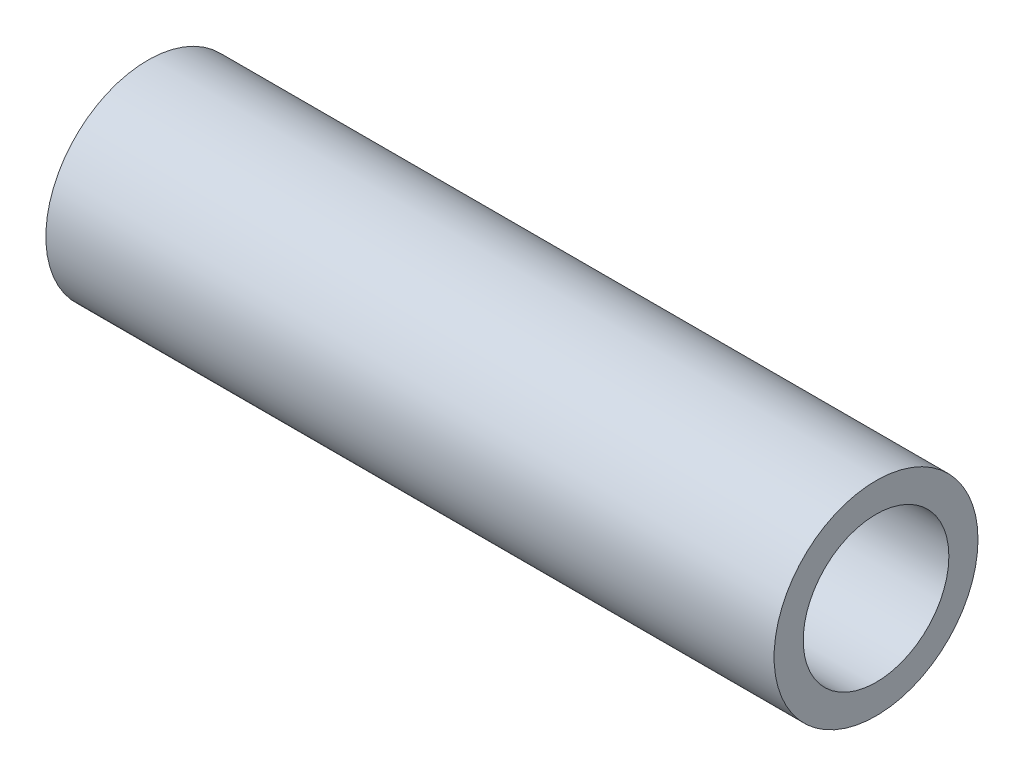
ISO-10303-21;
HEADER;
FILE_DESCRIPTION(('STEP AP214'),'2;1');
FILE_NAME('part.step','',(''),(''),'','','');
FILE_SCHEMA(('AUTOMOTIVE_DESIGN { 1 0 10303 214 1 1 1 1 }'));
ENDSEC;
DATA;
#1=APPLICATION_CONTEXT('core data for automotive mechanical design processes');
#2=APPLICATION_PROTOCOL_DEFINITION('international standard','automotive_design',2000,#1);
#3=PRODUCT_CONTEXT('',#1,'mechanical');
#4=PRODUCT('Part','Part','',(#3));
#5=PRODUCT_RELATED_PRODUCT_CATEGORY('part','',(#4));
#6=PRODUCT_DEFINITION_FORMATION('','',#4);
#7=PRODUCT_DEFINITION_CONTEXT('part definition',#1,'design');
#8=PRODUCT_DEFINITION('design','',#6,#7);
#9=PRODUCT_DEFINITION_SHAPE('','',#8);
#10=(LENGTH_UNIT() NAMED_UNIT(*) SI_UNIT(.MILLI.,.METRE.));
#11=(NAMED_UNIT(*) PLANE_ANGLE_UNIT() SI_UNIT($,.RADIAN.));
#12=(NAMED_UNIT(*) SI_UNIT($,.STERADIAN.) SOLID_ANGLE_UNIT());
#13=UNCERTAINTY_MEASURE_WITH_UNIT(LENGTH_MEASURE(1.E-05),#10,'distance_accuracy_value','');
#14=(GEOMETRIC_REPRESENTATION_CONTEXT(3) GLOBAL_UNCERTAINTY_ASSIGNED_CONTEXT((#13)) GLOBAL_UNIT_ASSIGNED_CONTEXT((#10,
#11,#12)) REPRESENTATION_CONTEXT('',''));
#15=CARTESIAN_POINT('',(0.,0.,0.));
#16=DIRECTION('',(0.,0.,1.));
#17=DIRECTION('',(1.,0.,0.));
#18=AXIS2_PLACEMENT_3D('',#15,#16,#17);
#19=CARTESIAN_POINT('',(25.,0.,0.));
#20=DIRECTION('',(1.,0.,0.));
#21=DIRECTION('',(0.,0.,-1.));
#22=AXIS2_PLACEMENT_3D('',#19,#20,#21);
#23=PLANE('',#22);
#24=CARTESIAN_POINT('',(25.,0.,0.));
#25=DIRECTION('',(1.,0.,0.));
#26=DIRECTION('',(0.,0.,-1.));
#27=AXIS2_PLACEMENT_3D('',#24,#25,#26);
#28=CIRCLE('',#27,3.5);
#29=CARTESIAN_POINT('',(25.,0.,-3.5));
#30=VERTEX_POINT('',#29);
#31=EDGE_CURVE('E10',#30,#30,#28,.T.);
#32=ORIENTED_EDGE('',*,*,#31,.T.);
#33=EDGE_LOOP('',(#32));
#34=FACE_BOUND('',#33,.T.);
#35=CARTESIAN_POINT('',(25.,0.,0.));
#36=DIRECTION('',(1.,0.,0.));
#37=DIRECTION('',(0.,0.,-1.));
#38=AXIS2_PLACEMENT_3D('',#35,#36,#37);
#39=CIRCLE('',#38,2.5);
#40=CARTESIAN_POINT('',(25.,0.,-2.5));
#41=VERTEX_POINT('',#40);
#42=EDGE_CURVE('E38',#41,#41,#39,.T.);
#43=ORIENTED_EDGE('',*,*,#42,.F.);
#44=EDGE_LOOP('',(#43));
#45=FACE_BOUND('',#44,.T.);
#46=ADVANCED_FACE('F27',(#34,#45),#23,.T.);
#47=CARTESIAN_POINT('',(0.,0.,0.));
#48=DIRECTION('',(1.,0.,0.));
#49=DIRECTION('',(0.,0.,-1.));
#50=AXIS2_PLACEMENT_3D('',#47,#48,#49);
#51=PLANE('',#50);
#52=CARTESIAN_POINT('',(0.,0.,0.));
#53=DIRECTION('',(1.,0.,0.));
#54=DIRECTION('',(0.,0.,-1.));
#55=AXIS2_PLACEMENT_3D('',#52,#53,#54);
#56=CIRCLE('',#55,3.5);
#57=CARTESIAN_POINT('',(0.,0.,-3.5));
#58=VERTEX_POINT('',#57);
#59=EDGE_CURVE('E34',#58,#58,#56,.T.);
#60=ORIENTED_EDGE('',*,*,#59,.F.);
#61=EDGE_LOOP('',(#60));
#62=FACE_BOUND('',#61,.T.);
#63=CARTESIAN_POINT('',(0.,0.,0.));
#64=DIRECTION('',(1.,0.,0.));
#65=DIRECTION('',(0.,0.,-1.));
#66=AXIS2_PLACEMENT_3D('',#63,#64,#65);
#67=CIRCLE('',#66,2.5);
#68=CARTESIAN_POINT('',(0.,0.,-2.5));
#69=VERTEX_POINT('',#68);
#70=EDGE_CURVE('E42',#69,#69,#67,.T.);
#71=ORIENTED_EDGE('',*,*,#70,.T.);
#72=EDGE_LOOP('',(#71));
#73=FACE_BOUND('',#72,.T.);
#74=ADVANCED_FACE('F48',(#62,#73),#51,.F.);
#75=CARTESIAN_POINT('',(25.,0.,0.));
#76=DIRECTION('',(-1.,0.,0.));
#77=DIRECTION('',(0.,0.,1.));
#78=AXIS2_PLACEMENT_3D('',#75,#76,#77);
#79=CYLINDRICAL_SURFACE('',#78,3.5);
#80=ORIENTED_EDGE('',*,*,#31,.F.);
#81=EDGE_LOOP('',(#80));
#82=FACE_BOUND('',#81,.T.);
#83=ORIENTED_EDGE('',*,*,#59,.T.);
#84=EDGE_LOOP('',(#83));
#85=FACE_BOUND('',#84,.T.);
#86=ADVANCED_FACE('F29',(#82,#85),#79,.T.);
#87=CARTESIAN_POINT('',(25.,0.,0.));
#88=DIRECTION('',(-1.,0.,0.));
#89=DIRECTION('',(0.,0.,1.));
#90=AXIS2_PLACEMENT_3D('',#87,#88,#89);
#91=CYLINDRICAL_SURFACE('',#90,2.5);
#92=ORIENTED_EDGE('',*,*,#42,.T.);
#93=EDGE_LOOP('',(#92));
#94=FACE_BOUND('',#93,.T.);
#95=ORIENTED_EDGE('',*,*,#70,.F.);
#96=EDGE_LOOP('',(#95));
#97=FACE_BOUND('',#96,.T.);
#98=ADVANCED_FACE('F50',(#94,#97),#91,.F.);
#99=CLOSED_SHELL('',(#46,#74,#86,#98));
#100=MANIFOLD_SOLID_BREP('B2',#99);
#101=ADVANCED_BREP_SHAPE_REPRESENTATION('',(#18,#100),#14);
#102=SHAPE_DEFINITION_REPRESENTATION(#9,#101);
ENDSEC;
END-ISO-10303-21;
